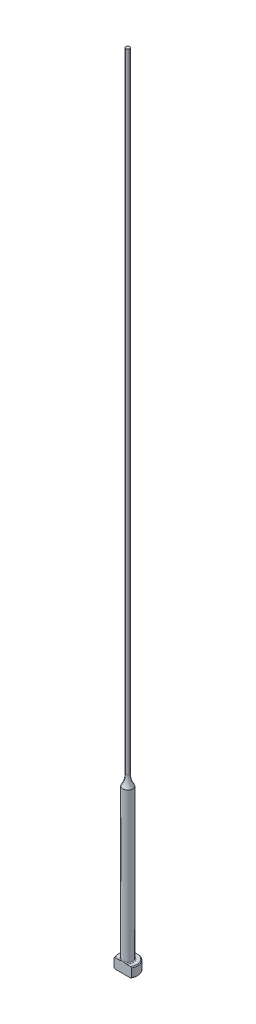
from build123d import *

# Parameters (mm, degrees)
CHAMFER1_SIZE      = 0.254
FILLET1_R          = 0.254
CUT_EXTRUDE1_DEPTH = 255.0396844


with BuildPart() as part:
    # Sketch1 → Revolve1 (revolve)
    with BuildSketch(Plane.XY, mode=Mode.PRIVATE) as revolve1_sk:
        with BuildLine():
            Line((0, 0), (-3.175, 0))
            Line((-3.175, 0), (-3.175, 3.175))
            Line((-3.175, 3.175), (-1.5875, 3.175))
            Line((-1.5875, 3.175), (-1.5875, 50.8))
            ThreePointArc((-1.5875, 50.8), (-0.847698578, 52.434042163), (-0.59436, 54.209772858))
            Line((-0.59436, 54.209772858), (-0.59436, 254))
            Line((-0.59436, 254), (0, 254))
            Line((0, 254), (0, 0))
        make_face()
    revolve(revolve1_sk.sketch.rotate(Axis((0, 259.958771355, 0), (0, -1, 0)), 270), axis=Axis((0, 259.958771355, 0), (0, -1, 0)))

    # Chamfer1
    chamfer1_edges = [part.edges().sort_by_distance(p)[0] for p in [
        (0, 0, -3.175),
        (0, 3.175, -3.175),
    ]]
    chamfer(chamfer1_edges, length=CHAMFER1_SIZE)

    # Fillet1
    fillet1_edges = [part.edges().sort_by_distance(p)[0] for p in [
        (0, 3.175, -1.5875),
    ]]
    fillet(fillet1_edges, radius=FILLET1_R)

    # Sketch2 → Cut-Extrude1 (cut, through all)
    with BuildSketch(Plane.XZ):
        with BuildLine():
            Line((-2.749630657, 1.5875), (2.749630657, 1.5875))
            ThreePointArc((2.749630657, 1.5875), (0, 3.175), (-2.749630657, 1.5875))
        make_face()
    extrude(amount=-CUT_EXTRUDE1_DEPTH, mode=Mode.SUBTRACT)


solid = part.part
